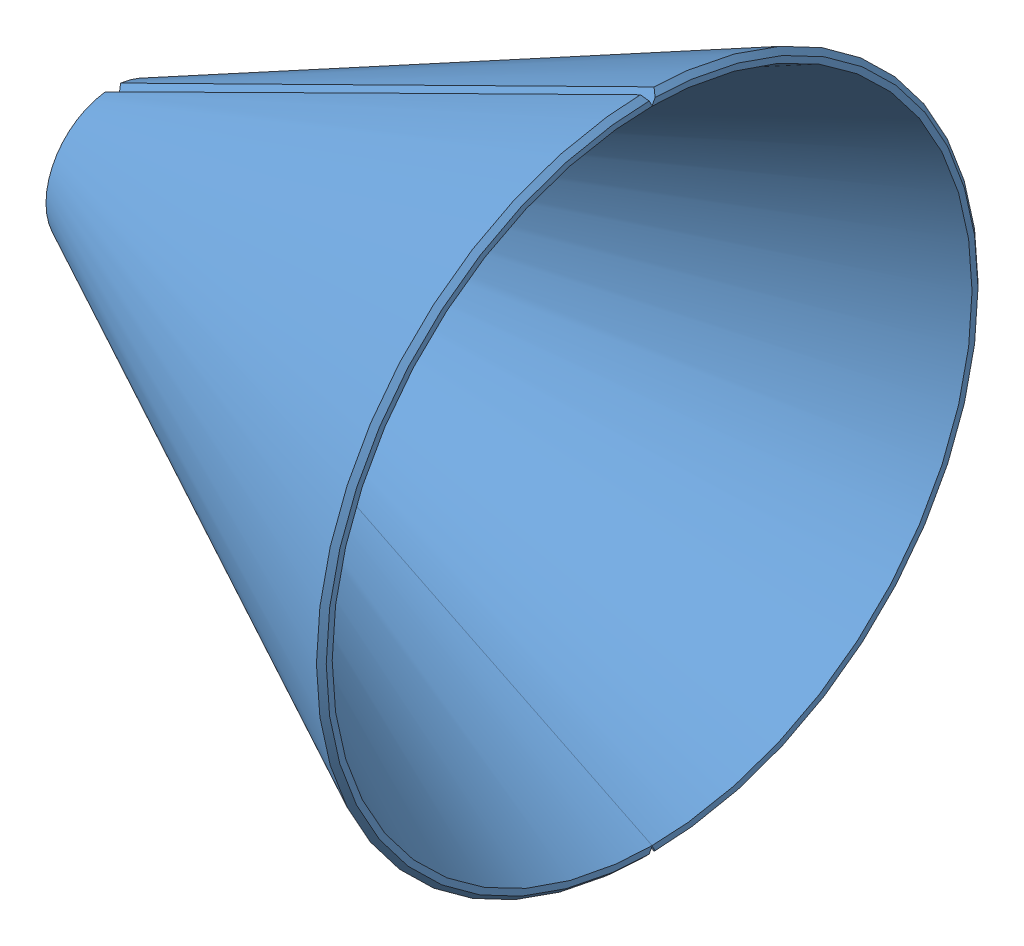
SolidWorks assembly bg_konus.SLDASM, configuration Default (file format 4100). Lengths in mm.
Overall size (181.23 222.44 222.12).
2 component instances, 1 part files, 2 mates.
Components (placement in the parent):
- halbschale_konus-1: halbschale_konus.SLDPRT [Standard<Wie bearbeitet>] at (72.3069 9.776 -55.5238) size (181.23 222.44 111.2)
- halbschale_konus-2: halbschale_konus.SLDPRT [Standard<Wie bearbeitet>] at (72.3069 9.776 -55.3478) x (1 0 0) z (0 0 -1) size (181.23 222.44 111.2)
Mates (geometry in assembly coordinates):
- Deckungsgleich11: coincident: point of halbschale_konus-1; point of halbschale_konus-2
- Deckungsgleich12: coincident: point of halbschale_konus-1; point of halbschale_konus-2
